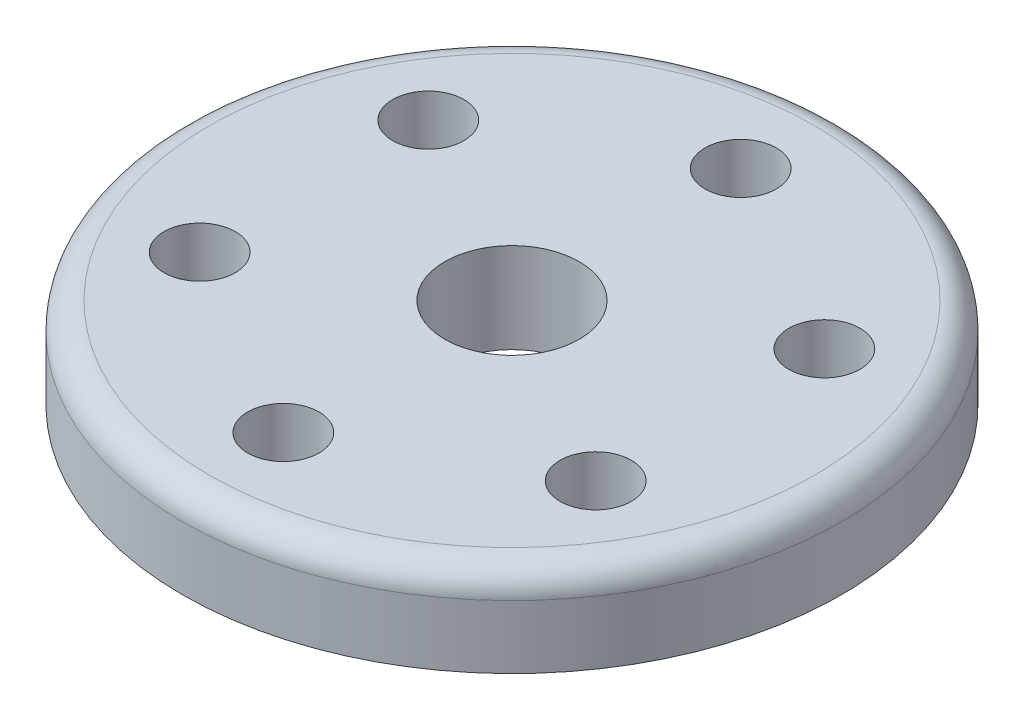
from build123d import *

# Parameters (mm, degrees)
ESQUISSE1_R                     = 24.5
ESQUISSE1_R_2                   = 5
BOSS_EXTRU_1_DEPTH              = 6.7
DIAM_TRE_DU_PER_AGE_5_3_5_3_1_D = 5.3
CONG_1_R                        = 2


with BuildPart() as part:
    # Esquisse1 → Boss.-Extru.1 (new body)
    with BuildSketch(Plane(origin=(0, 0, 0), x_dir=(1, 0, 0), z_dir=(0, 1, 0))):
        with Locations(Location((0, 0, 0), (0, 0, 270))):
            Circle(ESQUISSE1_R)
        with Locations(Location((0, 0, 0), (0, 0, 270))):
            Circle(ESQUISSE1_R_2, mode=Mode.SUBTRACT)
    extrude(amount=BOSS_EXTRU_1_DEPTH)

    # Diam_tre du per_age _5.3 _5.3_1 (through all)
    with Locations(Plane(origin=(0, 6.7, 0), x_dir=(1, 0, 0), z_dir=(0, 1, 0))):
        with Locations((0, 17), (14.722431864, 8.5), (14.722431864, -8.5), (0, -17), (-14.722431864, -8.5), (-14.722431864, 8.5)):
            Hole(DIAM_TRE_DU_PER_AGE_5_3_5_3_1_D / 2)

    # Cong_1
    cong_1_edges = [part.edges().sort_by_distance(p)[0] for p in [
        (0, 6.7, -24.5),
    ]]
    fillet(cong_1_edges, radius=CONG_1_R)


solid = part.part
